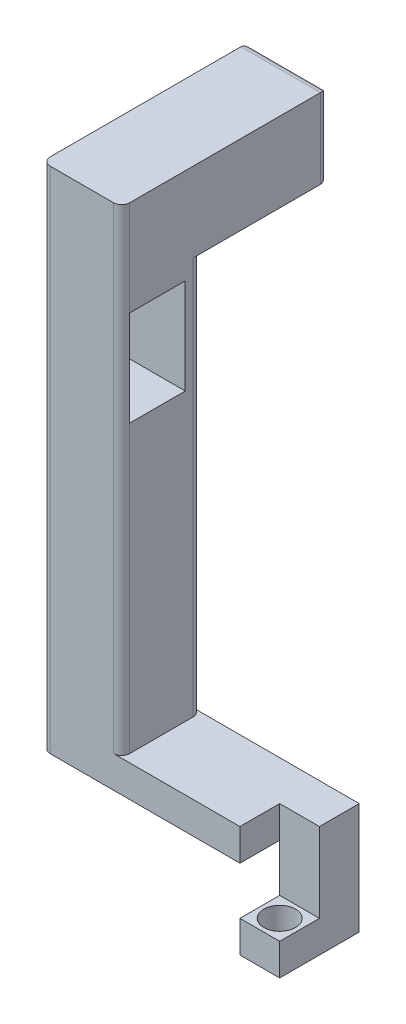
from build123d import *

# Parameters (mm, degrees)
SKETCH1_W           = 14.94
SKETCH1_H           = 5
BOSS_EXTRUDE1_DEPTH = 2
SKETCH3_W           = 5
SKETCH3_H           = 5
BOSS_EXTRUDE3_DEPTH = 30
SKETCH4_W           = 5
SKETCH4_H           = 5
BOSS_EXTRUDE4_DEPTH = 8
FILLET1_R           = 0.5
SKETCH7_W           = 3.5
SKETCH7_H           = 6
CUT_EXTRUDE3_DEPTH  = 8
SKETCH10_W          = 2.5
SKETCH10_H          = 5
BOSS_EXTRUDE5_DEPTH = 5
SKETCH11_W          = 2.5
SKETCH11_H          = 5
CUT_EXTRUDE4_DEPTH  = 2.5
CUT_EXTRUDE5_DEPTH  = 2.5


with BuildPart() as part:
    # Sketch1 → Boss-Extrude1 (new body)
    with BuildSketch(Plane(origin=(0, 0, 0), x_dir=(1, 0, 0), z_dir=(0, 1, 0))):
        Rectangle(SKETCH1_W, SKETCH1_H)
    extrude(amount=BOSS_EXTRUDE1_DEPTH)

    # Sketch3 → Boss-Extrude3 (add)
    with BuildSketch(Plane(origin=(0, 2, 0), x_dir=(1, 0, 0), z_dir=(0, 1, 0))):
        with Locations((-4.97, 0)):
            Rectangle(SKETCH3_W, SKETCH3_H)
    extrude(amount=BOSS_EXTRUDE3_DEPTH)

    # Sketch4 → Boss-Extrude4 (add)
    with BuildSketch(Plane(origin=(0, 0, -2.5), x_dir=(-1, 0, 0), z_dir=(0, 0, -1))):
        with Locations((4.97, 29.5)):
            Rectangle(SKETCH4_W, SKETCH4_H)
    extrude(amount=BOSS_EXTRUDE4_DEPTH)

    # Fillet1
    fillet1_edges = [part.edges().sort_by_distance(p)[0] for p in [
        (-2.47, 17, 2.5),
        (-7.47, 13.5, -2.5),
        (-2.47, 14.5, -2.5),
        (-2.47, 29.5, -10.5),
        (-4.97, 27, -10.5),
        (-7.47, 29.5, -10.5),
        (-4.97, 32, -10.5),
        (-7.47, 16, 2.5),
    ]]
    fillet(fillet1_edges, radius=FILLET1_R)

    # Sketch7 → Cut-Extrude3 (cut)
    with BuildSketch(Plane.ZY.offset(7.47)):
        with Locations((0.25, 23)):
            Rectangle(SKETCH7_W, SKETCH7_H)
    extrude(amount=-CUT_EXTRUDE3_DEPTH, mode=Mode.SUBTRACT)

    # Sketch10 → Boss-Extrude5 (add)
    with BuildSketch(Plane.XZ):
        with Locations((6.22, 0)):
            Rectangle(SKETCH10_W, SKETCH10_H)
    extrude(amount=BOSS_EXTRUDE5_DEPTH)

    # Sketch11 → Cut-Extrude4 (cut)
    with BuildSketch(Plane(origin=(7.47, 0, 0), x_dir=(0, 0, -1), z_dir=(1, 0, 0))):
        with Locations((-1.25, -0.5)):
            Rectangle(SKETCH11_W, SKETCH11_H)
    extrude(amount=-CUT_EXTRUDE4_DEPTH, mode=Mode.SUBTRACT)

    # Sketch12 → Cut-Extrude5 (cut)
    with BuildSketch(Plane(origin=(0, -3, 0), x_dir=(1, 0, 0), z_dir=(0, 1, 0))):
        with BuildLine():
            ThreePointArc((7.22, -1.25), (6.927106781, -0.542893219), (6.22, -0.25))
            Line((6.22, -0.25), (6.22, -2.25))
            ThreePointArc((6.22, -2.25), (6.927106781, -1.957106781), (7.22, -1.25))
        make_face()
        with BuildLine():
            Line((6.22, -2.25), (6.22, -0.25))
            ThreePointArc((6.22, -0.25), (5.22, -1.25), (6.22, -2.25))
        make_face()
        with BuildLine():
            ThreePointArc((7.22, -1.25), (6.927106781, -0.542893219), (6.22, -0.25))
            Line((6.22, -0.25), (6.22, -2.25))
            ThreePointArc((6.22, -2.25), (6.927106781, -1.957106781), (7.22, -1.25))
        make_face()
        with BuildLine():
            Line((6.22, -2.25), (6.22, -0.25))
            ThreePointArc((6.22, -0.25), (5.22, -1.25), (6.22, -2.25))
        make_face()
    extrude(amount=-CUT_EXTRUDE5_DEPTH, mode=Mode.SUBTRACT)


solid = part.part
